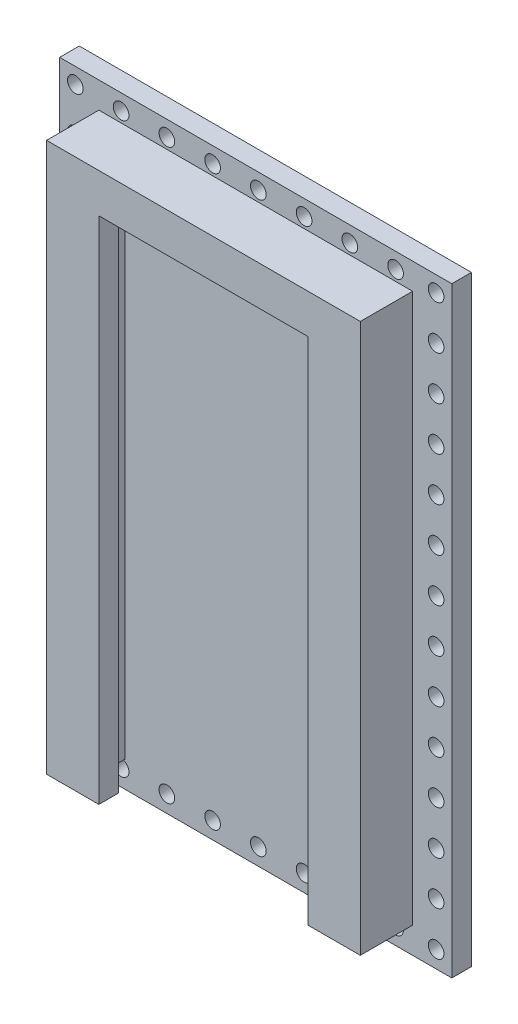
from build123d import *

# Parameters (mm, degrees)
BOSS_EXTRUDE1_DEPTH      = 1
BOSS_EXTRUDE1_DEPTH_BACK = 0.5
SKETCH1_W                = 30
SKETCH1_H                = 46
SKETCH2_R                = 0.6
CUT_EXTRUDE1_DEPTH       = 9
BOSS_EXTRUDE2_DEPTH      = 4
SKETCH4_W                = 20
SKETCH4_H                = 2.5
CUT_EXTRUDE2_DEPTH       = 39


with BuildPart() as part:
    # Sketch1 → Boss-Extrude1 (new, two sides: drawn at the far end of the back side and taken through both)
    with BuildSketch(Plane.XY.offset(-BOSS_EXTRUDE1_DEPTH_BACK)):
        Rectangle(SKETCH1_W, SKETCH1_H)
    extrude(amount=BOSS_EXTRUDE1_DEPTH + BOSS_EXTRUDE1_DEPTH_BACK)

    # Sketch2 → Cut-Extrude1 (cut)
    with BuildSketch(Plane.XY.offset(1)):
        with Locations((-13.8, 21.8)):
            Circle(SKETCH2_R)
        with Locations((-13.8, 18.453846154)):
            Circle(SKETCH2_R)
        with Locations((-13.8, 15.107692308)):
            Circle(SKETCH2_R)
        with Locations((-13.8, 11.761538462)):
            Circle(SKETCH2_R)
        with Locations((-13.8, 8.415384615)):
            Circle(SKETCH2_R)
        with Locations((-13.8, 5.069230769)):
            Circle(SKETCH2_R)
        with Locations((-13.8, 1.723076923)):
            Circle(SKETCH2_R)
        with Locations((-13.8, -1.623076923)):
            Circle(SKETCH2_R)
        with Locations((-13.8, -4.969230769)):
            Circle(SKETCH2_R)
        with Locations((-13.8, -8.315384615)):
            Circle(SKETCH2_R)
        with Locations((-13.8, -11.661538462)):
            Circle(SKETCH2_R)
        with Locations((-13.8, -15.007692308)):
            Circle(SKETCH2_R)
        with Locations((-13.8, -18.353846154)):
            Circle(SKETCH2_R)
        with Locations((-13.8, -21.7)):
            Circle(SKETCH2_R)
        with Locations((13.8, 21.8)):
            Circle(SKETCH2_R)
        with Locations((13.8, 18.453846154)):
            Circle(SKETCH2_R)
        with Locations((13.8, 15.107692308)):
            Circle(SKETCH2_R)
        with Locations((13.8, 11.761538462)):
            Circle(SKETCH2_R)
        with Locations((13.8, 8.415384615)):
            Circle(SKETCH2_R)
        with Locations((13.8, 5.069230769)):
            Circle(SKETCH2_R)
        with Locations((13.8, 1.723076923)):
            Circle(SKETCH2_R)
        with Locations((13.8, -1.623076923)):
            Circle(SKETCH2_R)
        with Locations((13.8, -4.969230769)):
            Circle(SKETCH2_R)
        with Locations((13.8, -8.315384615)):
            Circle(SKETCH2_R)
        with Locations((13.8, -11.661538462)):
            Circle(SKETCH2_R)
        with Locations((13.8, -15.007692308)):
            Circle(SKETCH2_R)
        with Locations((13.8, -18.353846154)):
            Circle(SKETCH2_R)
        with Locations((13.8, -21.7)):
            Circle(SKETCH2_R)
        with Locations((-10.3, 21.8)):
            Circle(SKETCH2_R)
        with Locations((-6.8, 21.8)):
            Circle(SKETCH2_R)
        with Locations((-3.3, 21.8)):
            Circle(SKETCH2_R)
        with Locations((0.2, 21.8)):
            Circle(SKETCH2_R)
        with Locations((3.7, 21.8)):
            Circle(SKETCH2_R)
        with Locations((7.2, 21.8)):
            Circle(SKETCH2_R)
        with Locations((10.7, 21.8)):
            Circle(SKETCH2_R)
        with Locations((-10.3, -21.7)):
            Circle(SKETCH2_R)
        with Locations((-6.8, -21.7)):
            Circle(SKETCH2_R)
        with Locations((-3.3, -21.7)):
            Circle(SKETCH2_R)
        with Locations((0.2, -21.7)):
            Circle(SKETCH2_R)
        with Locations((3.7, -21.7)):
            Circle(SKETCH2_R)
        with Locations((7.2, -21.7)):
            Circle(SKETCH2_R)
        with Locations((10.7, -21.7)):
            Circle(SKETCH2_R)
    extrude(amount=-CUT_EXTRUDE1_DEPTH, mode=Mode.SUBTRACT)

    # Sketch3 → Boss-Extrude2 (add)
    with BuildSketch(Plane.XY.offset(1)):
        Polygon((-8, -21), (-8, 18), (8, 18), (8, -21), (12, -21), (12, 21), (-12, 21), (-12, -21), align=None)
    extrude(amount=BOSS_EXTRUDE2_DEPTH)

    # Sketch4 → Cut-Extrude2 (cut)
    with BuildSketch(Plane.XZ.offset(21)):
        with Locations((0, 2.25)):
            Rectangle(SKETCH4_W, SKETCH4_H)
    extrude(amount=-CUT_EXTRUDE2_DEPTH, mode=Mode.SUBTRACT)


solid = part.part
